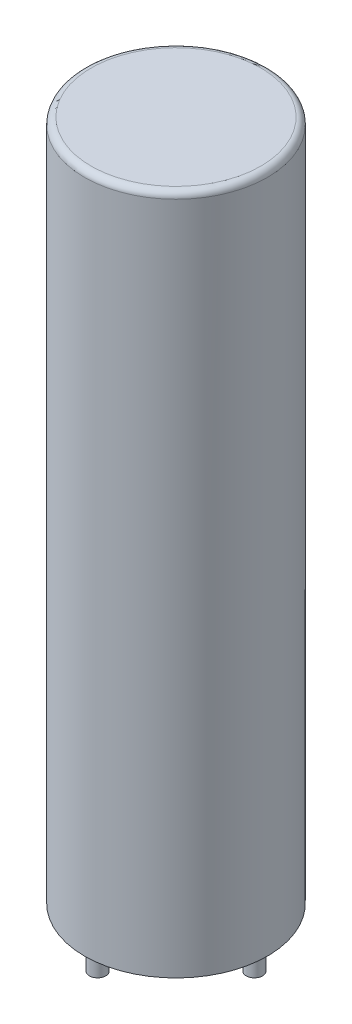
ISO-10303-21;
HEADER;
FILE_DESCRIPTION(('STEP AP214'),'2;1');
FILE_NAME('part.step','',(''),(''),'','','');
FILE_SCHEMA(('AUTOMOTIVE_DESIGN { 1 0 10303 214 1 1 1 1 }'));
ENDSEC;
DATA;
#1=APPLICATION_CONTEXT('core data for automotive mechanical design processes');
#2=APPLICATION_PROTOCOL_DEFINITION('international standard','automotive_design',2000,#1);
#3=PRODUCT_CONTEXT('',#1,'mechanical');
#4=PRODUCT('Part','Part','',(#3));
#5=PRODUCT_RELATED_PRODUCT_CATEGORY('part','',(#4));
#6=PRODUCT_DEFINITION_FORMATION('','',#4);
#7=PRODUCT_DEFINITION_CONTEXT('part definition',#1,'design');
#8=PRODUCT_DEFINITION('design','',#6,#7);
#9=PRODUCT_DEFINITION_SHAPE('','',#8);
#10=(LENGTH_UNIT() NAMED_UNIT(*) SI_UNIT(.MILLI.,.METRE.));
#11=(NAMED_UNIT(*) PLANE_ANGLE_UNIT() SI_UNIT($,.RADIAN.));
#12=(NAMED_UNIT(*) SI_UNIT($,.STERADIAN.) SOLID_ANGLE_UNIT());
#13=UNCERTAINTY_MEASURE_WITH_UNIT(LENGTH_MEASURE(1.E-05),#10,'distance_accuracy_value','');
#14=(GEOMETRIC_REPRESENTATION_CONTEXT(3) GLOBAL_UNCERTAINTY_ASSIGNED_CONTEXT((#13)) GLOBAL_UNIT_ASSIGNED_CONTEXT((#10,
#11,#12)) REPRESENTATION_CONTEXT('',''));
#15=CARTESIAN_POINT('',(0.,0.,0.));
#16=DIRECTION('',(0.,0.,1.));
#17=DIRECTION('',(1.,0.,0.));
#18=AXIS2_PLACEMENT_3D('',#15,#16,#17);
#19=CARTESIAN_POINT('',(0.,24.8,0.));
#20=DIRECTION('',(0.,-1.,0.));
#21=DIRECTION('',(1.,0.,0.));
#22=AXIS2_PLACEMENT_3D('',#19,#20,#21);
#23=PLANE('',#22);
#24=CARTESIAN_POINT('',(0.,24.8,0.));
#25=DIRECTION('',(0.,-1.,0.));
#26=DIRECTION('',(1.,0.,0.));
#27=AXIS2_PLACEMENT_3D('',#24,#25,#26);
#28=CIRCLE('',#27,10.);
#29=CARTESIAN_POINT('',(10.,24.8,0.));
#30=VERTEX_POINT('',#29);
#31=EDGE_CURVE('E59',#30,#30,#28,.T.);
#32=ORIENTED_EDGE('',*,*,#31,.T.);
#33=EDGE_LOOP('',(#32));
#34=FACE_BOUND('',#33,.T.);
#35=ADVANCED_FACE('F33',(#34),#23,.T.);
#36=CARTESIAN_POINT('',(0.,24.8,0.));
#37=DIRECTION('',(0.,-1.,0.));
#38=DIRECTION('',(1.,0.,0.));
#39=AXIS2_PLACEMENT_3D('',#36,#37,#38);
#40=CYLINDRICAL_SURFACE('',#39,10.);
#41=ORIENTED_EDGE('',*,*,#31,.F.);
#42=EDGE_LOOP('',(#41));
#43=FACE_BOUND('',#42,.T.);
#44=CARTESIAN_POINT('',(0.,15.8,0.));
#45=DIRECTION('',(0.,1.,0.));
#46=DIRECTION('',(0.,0.,1.));
#47=AXIS2_PLACEMENT_3D('',#44,#45,#46);
#48=CIRCLE('',#47,10.);
#49=CARTESIAN_POINT('',(0.,15.8,10.));
#50=VERTEX_POINT('',#49);
#51=EDGE_CURVE('E62',#50,#50,#48,.F.);
#52=ORIENTED_EDGE('',*,*,#51,.T.);
#53=EDGE_LOOP('',(#52));
#54=FACE_BOUND('',#53,.T.);
#55=ADVANCED_FACE('F94',(#43,#54),#40,.F.);
#56=CARTESIAN_POINT('',(0.,15.8,0.));
#57=DIRECTION('',(0.,1.,0.));
#58=DIRECTION('',(0.,0.,1.));
#59=AXIS2_PLACEMENT_3D('',#56,#57,#58);
#60=PLANE('',#59);
#61=CARTESIAN_POINT('',(-11.9999999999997,15.8,-3.41060513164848E-13));
#62=DIRECTION('',(0.,1.,0.));
#63=DIRECTION('',(0.,0.,1.));
#64=AXIS2_PLACEMENT_3D('',#61,#62,#63);
#65=CIRCLE('',#64,1.25);
#66=CARTESIAN_POINT('',(-11.9999999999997,15.8,1.24999999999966));
#67=VERTEX_POINT('',#66);
#68=EDGE_CURVE('E44',#67,#67,#65,.F.);
#69=ORIENTED_EDGE('',*,*,#68,.F.);
#70=EDGE_LOOP('',(#69));
#71=FACE_BOUND('',#70,.T.);
#72=CARTESIAN_POINT('',(6.79181874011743E-13,15.8,-12.));
#73=DIRECTION('',(0.,1.,0.));
#74=DIRECTION('',(0.,0.,1.));
#75=AXIS2_PLACEMENT_3D('',#72,#73,#74);
#76=CIRCLE('',#75,1.25);
#77=CARTESIAN_POINT('',(6.79181874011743E-13,15.8,-10.75));
#78=VERTEX_POINT('',#77);
#79=EDGE_CURVE('E48',#78,#78,#76,.F.);
#80=ORIENTED_EDGE('',*,*,#79,.F.);
#81=EDGE_LOOP('',(#80));
#82=FACE_BOUND('',#81,.T.);
#83=CARTESIAN_POINT('',(12.0000000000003,15.8,3.39590937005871E-13));
#84=DIRECTION('',(0.,1.,0.));
#85=DIRECTION('',(0.,0.,1.));
#86=AXIS2_PLACEMENT_3D('',#83,#84,#85);
#87=CIRCLE('',#86,1.25);
#88=CARTESIAN_POINT('',(12.0000000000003,15.8,1.25000000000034));
#89=VERTEX_POINT('',#88);
#90=EDGE_CURVE('E53',#89,#89,#87,.F.);
#91=ORIENTED_EDGE('',*,*,#90,.F.);
#92=EDGE_LOOP('',(#91));
#93=FACE_BOUND('',#92,.T.);
#94=CARTESIAN_POINT('',(0.,15.8,12.));
#95=DIRECTION('',(0.,1.,0.));
#96=DIRECTION('',(0.,0.,1.));
#97=AXIS2_PLACEMENT_3D('',#94,#95,#96);
#98=CIRCLE('',#97,1.25);
#99=CARTESIAN_POINT('',(0.,15.8,13.25));
#100=VERTEX_POINT('',#99);
#101=EDGE_CURVE('E56',#100,#100,#98,.F.);
#102=ORIENTED_EDGE('',*,*,#101,.F.);
#103=EDGE_LOOP('',(#102));
#104=FACE_BOUND('',#103,.T.);
#105=CARTESIAN_POINT('',(0.,15.8,0.));
#106=DIRECTION('',(0.,1.,0.));
#107=DIRECTION('',(0.,0.,1.));
#108=AXIS2_PLACEMENT_3D('',#105,#106,#107);
#109=CIRCLE('',#108,14.);
#110=CARTESIAN_POINT('',(0.,15.8,14.));
#111=VERTEX_POINT('',#110);
#112=EDGE_CURVE('E65',#111,#111,#109,.T.);
#113=ORIENTED_EDGE('',*,*,#112,.F.);
#114=EDGE_LOOP('',(#113));
#115=FACE_BOUND('',#114,.T.);
#116=ORIENTED_EDGE('',*,*,#51,.F.);
#117=EDGE_LOOP('',(#116));
#118=FACE_BOUND('',#117,.T.);
#119=ADVANCED_FACE('F90',(#71,#82,#93,#104,#115,#118),#60,.F.);
#120=CARTESIAN_POINT('',(0.,120.,0.));
#121=DIRECTION('',(0.,1.,0.));
#122=DIRECTION('',(-1.,0.,0.));
#123=AXIS2_PLACEMENT_3D('',#120,#121,#122);
#124=CYLINDRICAL_SURFACE('',#123,14.);
#125=CARTESIAN_POINT('',(0.,119.,0.));
#126=DIRECTION('',(0.,-1.,0.));
#127=DIRECTION('',(1.,0.,0.));
#128=AXIS2_PLACEMENT_3D('',#125,#126,#127);
#129=CIRCLE('',#128,14.);
#130=CARTESIAN_POINT('',(14.,119.,0.));
#131=VERTEX_POINT('',#130);
#132=EDGE_CURVE('E10',#131,#131,#129,.T.);
#133=ORIENTED_EDGE('',*,*,#132,.T.);
#134=EDGE_LOOP('',(#133));
#135=FACE_BOUND('',#134,.T.);
#136=ORIENTED_EDGE('',*,*,#112,.T.);
#137=EDGE_LOOP('',(#136));
#138=FACE_BOUND('',#137,.T.);
#139=ADVANCED_FACE('F93',(#135,#138),#124,.T.);
#140=CARTESIAN_POINT('',(14.,120.,0.));
#141=DIRECTION('',(0.,-1.,0.));
#142=DIRECTION('',(1.,0.,0.));
#143=AXIS2_PLACEMENT_3D('',#140,#141,#142);
#144=PLANE('',#143);
#145=CARTESIAN_POINT('',(0.,120.,0.));
#146=DIRECTION('',(0.,-1.,0.));
#147=DIRECTION('',(1.,0.,0.));
#148=AXIS2_PLACEMENT_3D('',#145,#146,#147);
#149=CIRCLE('',#148,13.);
#150=CARTESIAN_POINT('',(13.,120.,0.));
#151=VERTEX_POINT('',#150);
#152=EDGE_CURVE('E40',#151,#151,#149,.F.);
#153=ORIENTED_EDGE('',*,*,#152,.T.);
#154=EDGE_LOOP('',(#153));
#155=FACE_BOUND('',#154,.T.);
#156=ADVANCED_FACE('F117',(#155),#144,.F.);
#157=CARTESIAN_POINT('',(0.,12.8,12.));
#158=DIRECTION('',(0.,1.,0.));
#159=DIRECTION('',(0.,0.,1.));
#160=AXIS2_PLACEMENT_3D('',#157,#158,#159);
#161=CYLINDRICAL_SURFACE('',#160,1.25);
#162=CARTESIAN_POINT('',(0.,12.8,12.));
#163=DIRECTION('',(0.,-1.,0.));
#164=DIRECTION('',(0.,0.,-1.));
#165=AXIS2_PLACEMENT_3D('',#162,#163,#164);
#166=CIRCLE('',#165,1.25);
#167=CARTESIAN_POINT('',(0.,12.8,10.75));
#168=VERTEX_POINT('',#167);
#169=EDGE_CURVE('E68',#168,#168,#166,.T.);
#170=ORIENTED_EDGE('',*,*,#169,.F.);
#171=EDGE_LOOP('',(#170));
#172=FACE_BOUND('',#171,.T.);
#173=ORIENTED_EDGE('',*,*,#101,.T.);
#174=EDGE_LOOP('',(#173));
#175=FACE_BOUND('',#174,.T.);
#176=ADVANCED_FACE('F119',(#172,#175),#161,.T.);
#177=CARTESIAN_POINT('',(0.,12.8,12.));
#178=DIRECTION('',(0.,-1.,0.));
#179=DIRECTION('',(0.,0.,-1.));
#180=AXIS2_PLACEMENT_3D('',#177,#178,#179);
#181=PLANE('',#180);
#182=ORIENTED_EDGE('',*,*,#169,.T.);
#183=EDGE_LOOP('',(#182));
#184=FACE_BOUND('',#183,.T.);
#185=ADVANCED_FACE('F175',(#184),#181,.T.);
#186=CARTESIAN_POINT('',(12.0000000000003,12.8,3.39590937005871E-13));
#187=DIRECTION('',(0.,1.,0.));
#188=DIRECTION('',(0.,0.,1.));
#189=AXIS2_PLACEMENT_3D('',#186,#187,#188);
#190=CYLINDRICAL_SURFACE('',#189,1.25);
#191=CARTESIAN_POINT('',(12.0000000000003,12.8,3.39590937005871E-13));
#192=DIRECTION('',(0.,-1.,0.));
#193=DIRECTION('',(0.,0.,-1.));
#194=AXIS2_PLACEMENT_3D('',#191,#192,#193);
#195=CIRCLE('',#194,1.25);
#196=CARTESIAN_POINT('',(12.0000000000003,12.8,-1.24999999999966));
#197=VERTEX_POINT('',#196);
#198=EDGE_CURVE('E71',#197,#197,#195,.T.);
#199=ORIENTED_EDGE('',*,*,#198,.F.);
#200=EDGE_LOOP('',(#199));
#201=FACE_BOUND('',#200,.T.);
#202=ORIENTED_EDGE('',*,*,#90,.T.);
#203=EDGE_LOOP('',(#202));
#204=FACE_BOUND('',#203,.T.);
#205=ADVANCED_FACE('F167',(#201,#204),#190,.T.);
#206=CARTESIAN_POINT('',(12.0000000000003,12.8,3.39590937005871E-13));
#207=DIRECTION('',(0.,-1.,0.));
#208=DIRECTION('',(0.,0.,-1.));
#209=AXIS2_PLACEMENT_3D('',#206,#207,#208);
#210=PLANE('',#209);
#211=ORIENTED_EDGE('',*,*,#198,.T.);
#212=EDGE_LOOP('',(#211));
#213=FACE_BOUND('',#212,.T.);
#214=ADVANCED_FACE('F159',(#213),#210,.T.);
#215=CARTESIAN_POINT('',(6.79181874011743E-13,12.8,-12.));
#216=DIRECTION('',(0.,1.,0.));
#217=DIRECTION('',(0.,0.,1.));
#218=AXIS2_PLACEMENT_3D('',#215,#216,#217);
#219=CYLINDRICAL_SURFACE('',#218,1.25);
#220=CARTESIAN_POINT('',(6.79181874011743E-13,12.8,-12.));
#221=DIRECTION('',(0.,-1.,0.));
#222=DIRECTION('',(0.,0.,-1.));
#223=AXIS2_PLACEMENT_3D('',#220,#221,#222);
#224=CIRCLE('',#223,1.25);
#225=CARTESIAN_POINT('',(6.79181874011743E-13,12.8,-13.25));
#226=VERTEX_POINT('',#225);
#227=EDGE_CURVE('E74',#226,#226,#224,.T.);
#228=ORIENTED_EDGE('',*,*,#227,.F.);
#229=EDGE_LOOP('',(#228));
#230=FACE_BOUND('',#229,.T.);
#231=ORIENTED_EDGE('',*,*,#79,.T.);
#232=EDGE_LOOP('',(#231));
#233=FACE_BOUND('',#232,.T.);
#234=ADVANCED_FACE('F151',(#230,#233),#219,.T.);
#235=CARTESIAN_POINT('',(6.79181874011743E-13,12.8,-12.));
#236=DIRECTION('',(0.,-1.,0.));
#237=DIRECTION('',(0.,0.,-1.));
#238=AXIS2_PLACEMENT_3D('',#235,#236,#237);
#239=PLANE('',#238);
#240=ORIENTED_EDGE('',*,*,#227,.T.);
#241=EDGE_LOOP('',(#240));
#242=FACE_BOUND('',#241,.T.);
#243=ADVANCED_FACE('F86',(#242),#239,.T.);
#244=CARTESIAN_POINT('',(-11.9999999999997,12.8,-3.41060513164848E-13));
#245=DIRECTION('',(0.,1.,0.));
#246=DIRECTION('',(0.,0.,1.));
#247=AXIS2_PLACEMENT_3D('',#244,#245,#246);
#248=CYLINDRICAL_SURFACE('',#247,1.25);
#249=CARTESIAN_POINT('',(-11.9999999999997,12.8,-3.41060513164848E-13));
#250=DIRECTION('',(0.,-1.,0.));
#251=DIRECTION('',(0.,0.,-1.));
#252=AXIS2_PLACEMENT_3D('',#249,#250,#251);
#253=CIRCLE('',#252,1.25);
#254=CARTESIAN_POINT('',(-11.9999999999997,12.8,-1.25000000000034));
#255=VERTEX_POINT('',#254);
#256=EDGE_CURVE('E77',#255,#255,#253,.T.);
#257=ORIENTED_EDGE('',*,*,#256,.F.);
#258=EDGE_LOOP('',(#257));
#259=FACE_BOUND('',#258,.T.);
#260=ORIENTED_EDGE('',*,*,#68,.T.);
#261=EDGE_LOOP('',(#260));
#262=FACE_BOUND('',#261,.T.);
#263=ADVANCED_FACE('F83',(#259,#262),#248,.T.);
#264=CARTESIAN_POINT('',(-11.9999999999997,12.8,-3.41060513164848E-13));
#265=DIRECTION('',(0.,-1.,0.));
#266=DIRECTION('',(0.,0.,-1.));
#267=AXIS2_PLACEMENT_3D('',#264,#265,#266);
#268=PLANE('',#267);
#269=ORIENTED_EDGE('',*,*,#256,.T.);
#270=EDGE_LOOP('',(#269));
#271=FACE_BOUND('',#270,.T.);
#272=ADVANCED_FACE('F81',(#271),#268,.T.);
#273=CARTESIAN_POINT('',(0.,119.,0.));
#274=DIRECTION('',(0.,-1.,0.));
#275=DIRECTION('',(1.,0.,0.));
#276=AXIS2_PLACEMENT_3D('',#273,#274,#275);
#277=TOROIDAL_SURFACE('',#276,13.,1.);
#278=ORIENTED_EDGE('',*,*,#132,.F.);
#279=EDGE_LOOP('',(#278));
#280=FACE_BOUND('',#279,.T.);
#281=ORIENTED_EDGE('',*,*,#152,.F.);
#282=EDGE_LOOP('',(#281));
#283=FACE_BOUND('',#282,.T.);
#284=ADVANCED_FACE('F35',(#280,#283),#277,.T.);
#285=CLOSED_SHELL('',(#35,#55,#119,#139,#156,#176,#185,#205,#214,#234,#243,#263,#272,#284));
#286=MANIFOLD_SOLID_BREP('B2',#285);
#287=ADVANCED_BREP_SHAPE_REPRESENTATION('',(#18,#286),#14);
#288=SHAPE_DEFINITION_REPRESENTATION(#9,#287);
ENDSEC;
END-ISO-10303-21;
